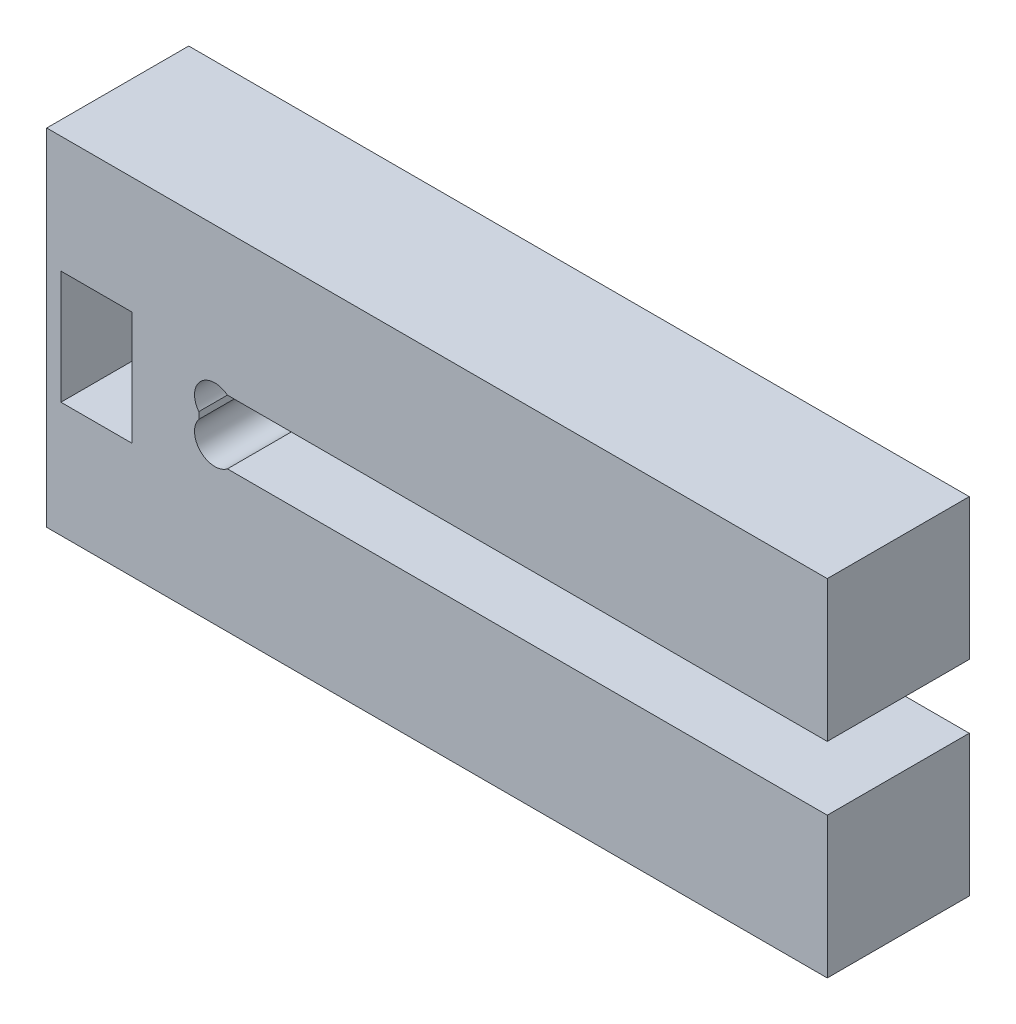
from build123d import *

# Parameters (mm, degrees)
BOSS_EXTRU_1_DEPTH      = 10
ESQUISSE3_W             = 5
ESQUISSE3_H             = 8
ENL_V_MAT_EXTRU_2_DEPTH = 9


with BuildPart() as part:
    # Esquisse1 → Boss.-Extru.1 (new body)
    with BuildSketch(Plane.XY):
        with BuildLine():
            Line((27.485, -2.25), (27.485, -12.18))
            Line((27.485, -12.18), (-27.485, -12.18))
            Line((-27.485, -12.18), (-27.485, 12.18))
            Line((-27.485, 12.18), (27.485, 12.18))
            Line((27.485, 12.18), (27.485, 2.25))
            Line((27.485, 2.25), (-14.7622583, 2.25))
            ThreePointArc((-14.7622583, 2.25), (-16.65773333, 2.13273333), (-16.775, 0.2372583))
            Line((-16.775, 0.2372583), (-16.775, -0.2372583))
            ThreePointArc((-16.775, -0.2372583), (-16.65773333, -2.13273333), (-14.7622583, -2.25))
            Line((-14.7622583, -2.25), (27.485, -2.25))
        make_face()
    extrude(amount=BOSS_EXTRU_1_DEPTH)

    # Esquisse3 → Enl_v. mat.-Extru.2 (cut)
    with BuildSketch(Plane.XY.offset(10)):
        with Locations((-23.985, -0.047282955)):
            Rectangle(ESQUISSE3_W, ESQUISSE3_H)
    extrude(amount=-ENL_V_MAT_EXTRU_2_DEPTH, mode=Mode.SUBTRACT)


solid = part.part
